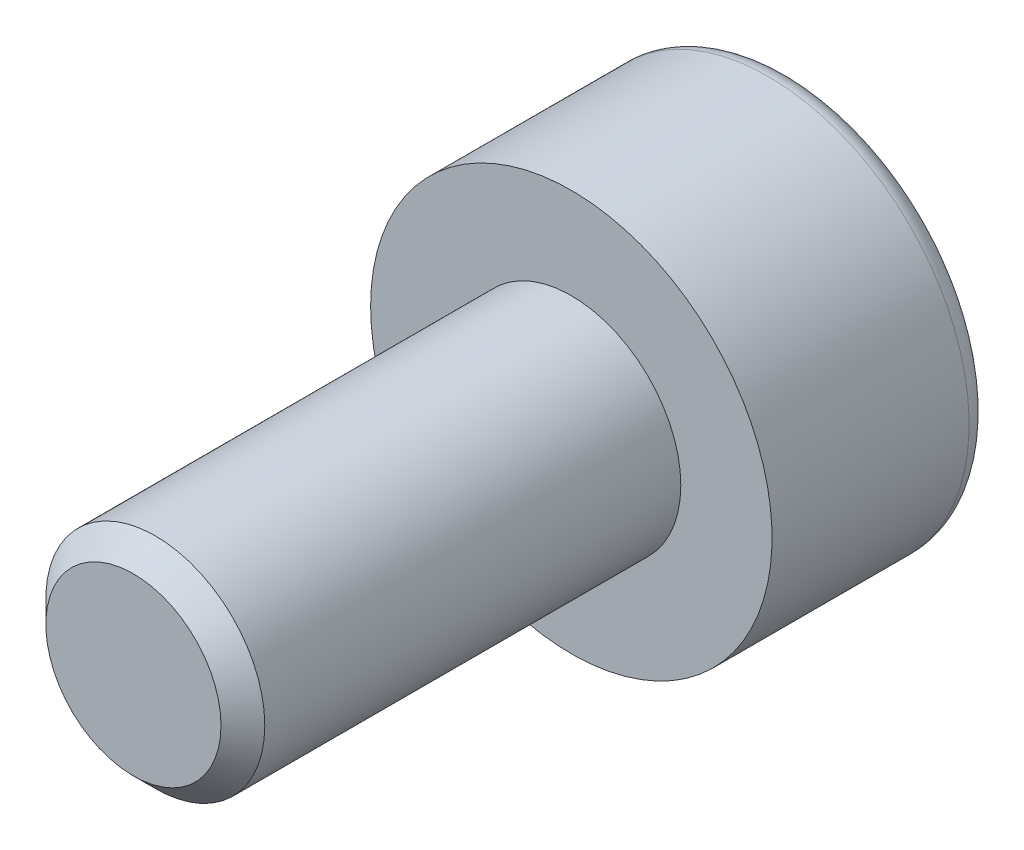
ISO-10303-21;
HEADER;
FILE_DESCRIPTION(('STEP AP214'),'2;1');
FILE_NAME('part.step','',(''),(''),'','','');
FILE_SCHEMA(('AUTOMOTIVE_DESIGN { 1 0 10303 214 1 1 1 1 }'));
ENDSEC;
DATA;
#1=APPLICATION_CONTEXT('core data for automotive mechanical design processes');
#2=APPLICATION_PROTOCOL_DEFINITION('international standard','automotive_design',2000,#1);
#3=PRODUCT_CONTEXT('',#1,'mechanical');
#4=PRODUCT('Part','Part','',(#3));
#5=PRODUCT_RELATED_PRODUCT_CATEGORY('part','',(#4));
#6=PRODUCT_DEFINITION_FORMATION('','',#4);
#7=PRODUCT_DEFINITION_CONTEXT('part definition',#1,'design');
#8=PRODUCT_DEFINITION('design','',#6,#7);
#9=PRODUCT_DEFINITION_SHAPE('','',#8);
#10=(LENGTH_UNIT() NAMED_UNIT(*) SI_UNIT(.MILLI.,.METRE.));
#11=(NAMED_UNIT(*) PLANE_ANGLE_UNIT() SI_UNIT($,.RADIAN.));
#12=(NAMED_UNIT(*) SI_UNIT($,.STERADIAN.) SOLID_ANGLE_UNIT());
#13=UNCERTAINTY_MEASURE_WITH_UNIT(LENGTH_MEASURE(1.E-05),#10,'distance_accuracy_value','');
#14=(GEOMETRIC_REPRESENTATION_CONTEXT(3) GLOBAL_UNCERTAINTY_ASSIGNED_CONTEXT((#13)) GLOBAL_UNIT_ASSIGNED_CONTEXT((#10,
#11,#12)) REPRESENTATION_CONTEXT('',''));
#15=CARTESIAN_POINT('',(0.,0.,0.));
#16=DIRECTION('',(0.,0.,1.));
#17=DIRECTION('',(1.,0.,0.));
#18=AXIS2_PLACEMENT_3D('',#15,#16,#17);
#19=CARTESIAN_POINT('',(0.,0.,-3.));
#20=DIRECTION('',(0.,0.,0.999999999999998));
#21=DIRECTION('',(0.999999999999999,0.,0.));
#22=AXIS2_PLACEMENT_3D('',#19,#20,#21);
#23=PLANE('',#22);
#24=CARTESIAN_POINT('',(0.,0.,-3.));
#25=DIRECTION('',(0.,0.,-0.999999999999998));
#26=DIRECTION('',(-0.999999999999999,0.,0.));
#27=AXIS2_PLACEMENT_3D('',#24,#25,#26);
#28=CIRCLE('',#27,2.45);
#29=CARTESIAN_POINT('',(-2.45,0.,-3.));
#30=VERTEX_POINT('',#29);
#31=EDGE_CURVE('E147',#30,#30,#28,.T.);
#32=ORIENTED_EDGE('',*,*,#31,.T.);
#33=EDGE_LOOP('',(#32));
#34=FACE_BOUND('',#33,.T.);
#35=DIRECTION('',(-0.86602540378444,0.499999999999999,0.));
#36=VECTOR('',#35,1.);
#37=CARTESIAN_POINT('',(0.,1.44337567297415,-2.99999999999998));
#38=LINE('',#37,#36);
#39=CARTESIAN_POINT('',(1.25000000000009,0.721687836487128,-2.99999999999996));
#40=VERTEX_POINT('',#39);
#41=CARTESIAN_POINT('',(0.,1.44337567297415,-2.99999999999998));
#42=VERTEX_POINT('',#41);
#43=EDGE_CURVE('E49',#40,#42,#38,.T.);
#44=ORIENTED_EDGE('',*,*,#43,.T.);
#45=DIRECTION('',(-0.866025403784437,-0.500000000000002,0.));
#46=VECTOR('',#45,1.);
#47=CARTESIAN_POINT('',(0.,1.44337567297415,-2.99999999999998));
#48=LINE('',#47,#46);
#49=CARTESIAN_POINT('',(-1.24999999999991,0.721687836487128,-3.));
#50=VERTEX_POINT('',#49);
#51=EDGE_CURVE('E120',#42,#50,#48,.T.);
#52=ORIENTED_EDGE('',*,*,#51,.T.);
#53=DIRECTION('',(0.,-1.,0.));
#54=VECTOR('',#53,1.);
#55=CARTESIAN_POINT('',(-1.2499999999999,-0.721687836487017,-3.00000000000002));
#56=LINE('',#55,#54);
#57=CARTESIAN_POINT('',(-1.2499999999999,-0.721687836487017,-3.00000000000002));
#58=VERTEX_POINT('',#57);
#59=EDGE_CURVE('E124',#50,#58,#56,.T.);
#60=ORIENTED_EDGE('',*,*,#59,.T.);
#61=DIRECTION('',(0.866025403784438,-0.500000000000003,0.));
#62=VECTOR('',#61,1.);
#63=CARTESIAN_POINT('',(0.,-1.44337567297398,-3.));
#64=LINE('',#63,#62);
#65=CARTESIAN_POINT('',(0.,-1.44337567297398,-3.));
#66=VERTEX_POINT('',#65);
#67=EDGE_CURVE('E127',#58,#66,#64,.T.);
#68=ORIENTED_EDGE('',*,*,#67,.T.);
#69=DIRECTION('',(0.866025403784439,0.499999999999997,0.));
#70=VECTOR('',#69,1.);
#71=CARTESIAN_POINT('',(0.,-1.44337567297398,-3.));
#72=LINE('',#71,#70);
#73=CARTESIAN_POINT('',(1.2500000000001,-0.721687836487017,-3.00000000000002));
#74=VERTEX_POINT('',#73);
#75=EDGE_CURVE('E110',#66,#74,#72,.T.);
#76=ORIENTED_EDGE('',*,*,#75,.T.);
#77=DIRECTION('',(0.,1.,0.));
#78=VECTOR('',#77,1.);
#79=CARTESIAN_POINT('',(1.2500000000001,-0.721687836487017,-3.00000000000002));
#80=LINE('',#79,#78);
#81=EDGE_CURVE('E130',#74,#40,#80,.T.);
#82=ORIENTED_EDGE('',*,*,#81,.T.);
#83=EDGE_LOOP('',(#44,#52,#60,#68,#76,#82));
#84=FACE_BOUND('',#83,.T.);
#85=ADVANCED_FACE('F34',(#34,#84),#23,.F.);
#86=CARTESIAN_POINT('',(0.,0.,-2.69999999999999));
#87=DIRECTION('',(0.,0.,-0.999999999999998));
#88=DIRECTION('',(-0.999999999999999,0.,0.));
#89=AXIS2_PLACEMENT_3D('',#86,#87,#88);
#90=TOROIDAL_SURFACE('',#89,2.45,0.299999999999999);
#91=ORIENTED_EDGE('',*,*,#31,.F.);
#92=EDGE_LOOP('',(#91));
#93=FACE_BOUND('',#92,.T.);
#94=CARTESIAN_POINT('',(0.,0.,-2.69999999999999));
#95=DIRECTION('',(0.,0.,-0.999999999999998));
#96=DIRECTION('',(-0.999999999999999,0.,0.));
#97=AXIS2_PLACEMENT_3D('',#94,#95,#96);
#98=CIRCLE('',#97,2.75);
#99=CARTESIAN_POINT('',(-2.75,0.,-2.7));
#100=VERTEX_POINT('',#99);
#101=EDGE_CURVE('E144',#100,#100,#98,.T.);
#102=ORIENTED_EDGE('',*,*,#101,.T.);
#103=EDGE_LOOP('',(#102));
#104=FACE_BOUND('',#103,.T.);
#105=ADVANCED_FACE('F164',(#93,#104),#90,.T.);
#106=CARTESIAN_POINT('',(0.,0.,0.));
#107=DIRECTION('',(0.,0.,-0.999999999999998));
#108=DIRECTION('',(-0.999999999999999,0.,0.));
#109=AXIS2_PLACEMENT_3D('',#106,#107,#108);
#110=CYLINDRICAL_SURFACE('',#109,2.75);
#111=CARTESIAN_POINT('',(0.,0.,0.));
#112=DIRECTION('',(0.,0.,-0.999999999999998));
#113=DIRECTION('',(-0.999999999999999,0.,0.));
#114=AXIS2_PLACEMENT_3D('',#111,#112,#113);
#115=CIRCLE('',#114,2.75);
#116=CARTESIAN_POINT('',(-2.75,0.,0.));
#117=VERTEX_POINT('',#116);
#118=EDGE_CURVE('E141',#117,#117,#115,.T.);
#119=CARTESIAN_POINT('',(-2.75,0.,-2.7));
#120=CARTESIAN_POINT('',(-2.75,0.,-2.671875));
#121=CARTESIAN_POINT('',(-2.75,0.,-2.64375));
#122=CARTESIAN_POINT('',(-2.75,0.,-2.5875));
#123=CARTESIAN_POINT('',(-2.75,0.,-2.559375));
#124=CARTESIAN_POINT('',(-2.75,0.,-2.503125));
#125=CARTESIAN_POINT('',(-2.75,0.,-2.475));
#126=CARTESIAN_POINT('',(-2.75,0.,-2.41875));
#127=CARTESIAN_POINT('',(-2.75,0.,-2.390625));
#128=CARTESIAN_POINT('',(-2.75,0.,-2.334375));
#129=CARTESIAN_POINT('',(-2.75,0.,-2.30625));
#130=CARTESIAN_POINT('',(-2.75,0.,-2.25));
#131=CARTESIAN_POINT('',(-2.75,0.,-2.221875));
#132=CARTESIAN_POINT('',(-2.75,0.,-2.165625));
#133=CARTESIAN_POINT('',(-2.75,0.,-2.1375));
#134=CARTESIAN_POINT('',(-2.75,0.,-2.08125));
#135=CARTESIAN_POINT('',(-2.75,0.,-2.053125));
#136=CARTESIAN_POINT('',(-2.75,0.,-1.996875));
#137=CARTESIAN_POINT('',(-2.75,0.,-1.96875));
#138=CARTESIAN_POINT('',(-2.75,0.,-1.9125));
#139=CARTESIAN_POINT('',(-2.75,0.,-1.884375));
#140=CARTESIAN_POINT('',(-2.75,0.,-1.828125));
#141=CARTESIAN_POINT('',(-2.75,0.,-1.8));
#142=CARTESIAN_POINT('',(-2.75,0.,-1.74375));
#143=CARTESIAN_POINT('',(-2.75,0.,-1.715625));
#144=CARTESIAN_POINT('',(-2.75,0.,-1.659375));
#145=CARTESIAN_POINT('',(-2.75,0.,-1.63125));
#146=CARTESIAN_POINT('',(-2.75,0.,-1.575));
#147=CARTESIAN_POINT('',(-2.75,0.,-1.546875));
#148=CARTESIAN_POINT('',(-2.75,0.,-1.490625));
#149=CARTESIAN_POINT('',(-2.75,0.,-1.4625));
#150=CARTESIAN_POINT('',(-2.75,0.,-1.40625));
#151=CARTESIAN_POINT('',(-2.75,0.,-1.378125));
#152=CARTESIAN_POINT('',(-2.75,0.,-1.321875));
#153=CARTESIAN_POINT('',(-2.75,0.,-1.29375));
#154=CARTESIAN_POINT('',(-2.75,0.,-1.2375));
#155=CARTESIAN_POINT('',(-2.75,0.,-1.209375));
#156=CARTESIAN_POINT('',(-2.75,0.,-1.153125));
#157=CARTESIAN_POINT('',(-2.75,0.,-1.125));
#158=CARTESIAN_POINT('',(-2.75,0.,-1.06875));
#159=CARTESIAN_POINT('',(-2.75,0.,-1.040625));
#160=CARTESIAN_POINT('',(-2.75,0.,-0.984375));
#161=CARTESIAN_POINT('',(-2.75,0.,-0.95625));
#162=CARTESIAN_POINT('',(-2.75,0.,-0.9));
#163=CARTESIAN_POINT('',(-2.75,0.,-0.871875));
#164=CARTESIAN_POINT('',(-2.75,0.,-0.815625));
#165=CARTESIAN_POINT('',(-2.75,0.,-0.7875));
#166=CARTESIAN_POINT('',(-2.75,0.,-0.73125));
#167=CARTESIAN_POINT('',(-2.75,0.,-0.703125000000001));
#168=CARTESIAN_POINT('',(-2.75,0.,-0.646875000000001));
#169=CARTESIAN_POINT('',(-2.75,0.,-0.618750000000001));
#170=CARTESIAN_POINT('',(-2.75,0.,-0.562500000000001));
#171=CARTESIAN_POINT('',(-2.75,0.,-0.534375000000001));
#172=CARTESIAN_POINT('',(-2.75,0.,-0.478125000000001));
#173=CARTESIAN_POINT('',(-2.75,0.,-0.450000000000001));
#174=CARTESIAN_POINT('',(-2.75,0.,-0.393750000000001));
#175=CARTESIAN_POINT('',(-2.75,0.,-0.365625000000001));
#176=CARTESIAN_POINT('',(-2.75,0.,-0.309375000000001));
#177=CARTESIAN_POINT('',(-2.75,0.,-0.281250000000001));
#178=CARTESIAN_POINT('',(-2.75,0.,-0.225000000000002));
#179=CARTESIAN_POINT('',(-2.75,0.,-0.196875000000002));
#180=CARTESIAN_POINT('',(-2.75,0.,-0.140625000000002));
#181=CARTESIAN_POINT('',(-2.75,0.,-0.112500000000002));
#182=CARTESIAN_POINT('',(-2.75,0.,-0.0562500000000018));
#183=CARTESIAN_POINT('',(-2.75,0.,-0.0281250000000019));
#184=CARTESIAN_POINT('',(-2.75,0.,0.));
#185=B_SPLINE_CURVE_WITH_KNOTS('',3,(#119,#120,#121,#122,#123,#124,#125,#126,#127,#128,#129,
#130,#131,#132,#133,#134,#135,#136,#137,#138,#139,#140,#141,#142,#143,#144,#145,#146,#147,#148,
#149,#150,#151,#152,#153,#154,#155,#156,#157,#158,#159,#160,#161,#162,#163,#164,#165,#166,#167,
#168,#169,#170,#171,#172,#173,#174,#175,#176,#177,#178,#179,#180,#181,#182,#183,#184),
.UNSPECIFIED.,.F.,.F.,(4,2,2,2,2,2,2,2,2,2,2,2,2,2,2,2,2,2,2,2,2,2,2,2,2,2,2,2,2,2,2,2,4),(0.,
0.0843749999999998,0.16875,0.253124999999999,0.337499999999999,0.421874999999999,
0.506249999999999,0.590624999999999,0.674999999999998,0.759374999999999,0.843749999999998,
0.928124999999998,1.0125,1.096875,1.18125,1.265625,1.35,1.434375,1.51875,1.603125,1.6875,
1.771875,1.85625,1.940625,2.025,2.109375,2.19375,2.27812499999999,2.3625,2.446875,
2.53124999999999,2.615625,2.69999999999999),.UNSPECIFIED.);
#186=EDGE_CURVE('BSEAM169',#100,#117,#185,.T.);
#187=ORIENTED_EDGE('',*,*,#101,.F.);
#188=ORIENTED_EDGE('',*,*,#118,.T.);
#189=ORIENTED_EDGE('',*,*,#186,.T.);
#190=ORIENTED_EDGE('',*,*,#186,.F.);
#191=EDGE_LOOP('',(#187,#189,#188,#190));
#192=FACE_BOUND('',#191,.T.);
#193=ADVANCED_FACE('F169',(#192),#110,.T.);
#194=CARTESIAN_POINT('',(0.,0.,0.));
#195=DIRECTION('',(0.,0.,-0.999999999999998));
#196=DIRECTION('',(-0.999999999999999,0.,0.));
#197=AXIS2_PLACEMENT_3D('',#194,#195,#196);
#198=PLANE('',#197);
#199=CARTESIAN_POINT('',(0.,0.,0.));
#200=DIRECTION('',(0.,0.,0.999999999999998));
#201=DIRECTION('',(0.999999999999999,0.,0.));
#202=AXIS2_PLACEMENT_3D('',#199,#200,#201);
#203=CIRCLE('',#202,1.5);
#204=CARTESIAN_POINT('',(1.5,0.,0.));
#205=VERTEX_POINT('',#204);
#206=EDGE_CURVE('E121',#205,#205,#203,.T.);
#207=ORIENTED_EDGE('',*,*,#206,.F.);
#208=EDGE_LOOP('',(#207));
#209=FACE_BOUND('',#208,.T.);
#210=ORIENTED_EDGE('',*,*,#118,.F.);
#211=EDGE_LOOP('',(#210));
#212=FACE_BOUND('',#211,.T.);
#213=ADVANCED_FACE('F176',(#209,#212),#198,.F.);
#214=CARTESIAN_POINT('',(0.,1.44337567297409,-1.69999999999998));
#215=DIRECTION('',(-0.499999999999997,-0.86602540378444,0.));
#216=DIRECTION('',(0.86602540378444,-0.499999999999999,0.));
#217=AXIS2_PLACEMENT_3D('',#214,#215,#216);
#218=PLANE('',#217);
#219=ORIENTED_EDGE('',*,*,#43,.F.);
#220=DIRECTION('',(0.,0.,-0.999999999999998));
#221=VECTOR('',#220,1.);
#222=CARTESIAN_POINT('',(1.24999999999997,0.721687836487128,-1.69999999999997));
#223=LINE('',#222,#221);
#224=CARTESIAN_POINT('',(1.24999999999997,0.721687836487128,-1.69999999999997));
#225=VERTEX_POINT('',#224);
#226=EDGE_CURVE('E115',#225,#40,#223,.T.);
#227=ORIENTED_EDGE('',*,*,#226,.F.);
#228=DIRECTION('',(-0.86602540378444,0.499999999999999,0.));
#229=VECTOR('',#228,1.);
#230=CARTESIAN_POINT('',(0.,1.44337567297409,-1.69999999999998));
#231=LINE('',#230,#229);
#232=CARTESIAN_POINT('',(0.,1.44337567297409,-1.69999999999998));
#233=VERTEX_POINT('',#232);
#234=EDGE_CURVE('E133',#225,#233,#231,.T.);
#235=ORIENTED_EDGE('',*,*,#234,.T.);
#236=DIRECTION('',(0.,0.,-0.999999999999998));
#237=VECTOR('',#236,1.);
#238=CARTESIAN_POINT('',(0.,1.44337567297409,-1.69999999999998));
#239=LINE('',#238,#237);
#240=EDGE_CURVE('E139',#233,#42,#239,.T.);
#241=ORIENTED_EDGE('',*,*,#240,.T.);
#242=EDGE_LOOP('',(#219,#227,#235,#241));
#243=FACE_BOUND('',#242,.T.);
#244=ADVANCED_FACE('F180',(#243),#218,.T.);
#245=CARTESIAN_POINT('',(0.,1.44337567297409,-1.69999999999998));
#246=DIRECTION('',(0.500000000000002,-0.866025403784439,0.));
#247=DIRECTION('',(0.866025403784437,0.500000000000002,0.));
#248=AXIS2_PLACEMENT_3D('',#245,#246,#247);
#249=PLANE('',#248);
#250=ORIENTED_EDGE('',*,*,#51,.F.);
#251=ORIENTED_EDGE('',*,*,#240,.F.);
#252=DIRECTION('',(-0.866025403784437,-0.500000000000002,0.));
#253=VECTOR('',#252,1.);
#254=CARTESIAN_POINT('',(0.,1.44337567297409,-1.69999999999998));
#255=LINE('',#254,#253);
#256=CARTESIAN_POINT('',(-1.25000000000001,0.721687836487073,-1.69999999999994));
#257=VERTEX_POINT('',#256);
#258=EDGE_CURVE('E88',#233,#257,#255,.T.);
#259=ORIENTED_EDGE('',*,*,#258,.T.);
#260=DIRECTION('',(0.,0.,-0.999999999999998));
#261=VECTOR('',#260,1.);
#262=CARTESIAN_POINT('',(-1.25000000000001,0.721687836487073,-1.69999999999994));
#263=LINE('',#262,#261);
#264=EDGE_CURVE('E137',#257,#50,#263,.T.);
#265=ORIENTED_EDGE('',*,*,#264,.T.);
#266=EDGE_LOOP('',(#250,#251,#259,#265));
#267=FACE_BOUND('',#266,.T.);
#268=ADVANCED_FACE('F184',(#267),#249,.T.);
#269=CARTESIAN_POINT('',(-1.24999999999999,-0.721687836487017,-1.70000000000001));
#270=DIRECTION('',(0.999999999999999,0.,0.));
#271=DIRECTION('',(0.,0.,-0.999999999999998));
#272=AXIS2_PLACEMENT_3D('',#269,#270,#271);
#273=PLANE('',#272);
#274=ORIENTED_EDGE('',*,*,#59,.F.);
#275=ORIENTED_EDGE('',*,*,#264,.F.);
#276=DIRECTION('',(0.,-1.,0.));
#277=VECTOR('',#276,1.);
#278=CARTESIAN_POINT('',(-1.24999999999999,-0.721687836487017,-1.70000000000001));
#279=LINE('',#278,#277);
#280=CARTESIAN_POINT('',(-1.24999999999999,-0.721687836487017,-1.70000000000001));
#281=VERTEX_POINT('',#280);
#282=EDGE_CURVE('E106',#257,#281,#279,.T.);
#283=ORIENTED_EDGE('',*,*,#282,.T.);
#284=DIRECTION('',(0.,0.,-0.999999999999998));
#285=VECTOR('',#284,1.);
#286=CARTESIAN_POINT('',(-1.24999999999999,-0.721687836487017,-1.70000000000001));
#287=LINE('',#286,#285);
#288=EDGE_CURVE('E103',#281,#58,#287,.T.);
#289=ORIENTED_EDGE('',*,*,#288,.T.);
#290=EDGE_LOOP('',(#274,#275,#283,#289));
#291=FACE_BOUND('',#290,.T.);
#292=ADVANCED_FACE('F187',(#291),#273,.T.);
#293=CARTESIAN_POINT('',(0.,-1.44337567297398,-1.69999999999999));
#294=DIRECTION('',(0.500000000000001,0.866025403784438,0.));
#295=DIRECTION('',(-0.866025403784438,0.500000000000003,0.));
#296=AXIS2_PLACEMENT_3D('',#293,#294,#295);
#297=PLANE('',#296);
#298=ORIENTED_EDGE('',*,*,#67,.F.);
#299=ORIENTED_EDGE('',*,*,#288,.F.);
#300=DIRECTION('',(0.866025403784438,-0.500000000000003,0.));
#301=VECTOR('',#300,1.);
#302=CARTESIAN_POINT('',(0.,-1.44337567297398,-1.69999999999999));
#303=LINE('',#302,#301);
#304=CARTESIAN_POINT('',(0.,-1.44337567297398,-1.69999999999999));
#305=VERTEX_POINT('',#304);
#306=EDGE_CURVE('E98',#281,#305,#303,.T.);
#307=ORIENTED_EDGE('',*,*,#306,.T.);
#308=DIRECTION('',(0.,0.,-0.999999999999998));
#309=VECTOR('',#308,1.);
#310=CARTESIAN_POINT('',(0.,-1.44337567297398,-1.69999999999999));
#311=LINE('',#310,#309);
#312=EDGE_CURVE('E102',#305,#66,#311,.T.);
#313=ORIENTED_EDGE('',*,*,#312,.T.);
#314=EDGE_LOOP('',(#298,#299,#307,#313));
#315=FACE_BOUND('',#314,.T.);
#316=ADVANCED_FACE('F101',(#315),#297,.T.);
#317=CARTESIAN_POINT('',(0.,-1.44337567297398,-1.69999999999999));
#318=DIRECTION('',(-0.499999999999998,0.866025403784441,0.));
#319=DIRECTION('',(-0.866025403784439,-0.499999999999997,0.));
#320=AXIS2_PLACEMENT_3D('',#317,#318,#319);
#321=PLANE('',#320);
#322=ORIENTED_EDGE('',*,*,#75,.F.);
#323=ORIENTED_EDGE('',*,*,#312,.F.);
#324=DIRECTION('',(0.866025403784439,0.499999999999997,0.));
#325=VECTOR('',#324,1.);
#326=CARTESIAN_POINT('',(0.,-1.44337567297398,-1.69999999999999));
#327=LINE('',#326,#325);
#328=CARTESIAN_POINT('',(1.25000000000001,-0.721687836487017,-1.70000000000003));
#329=VERTEX_POINT('',#328);
#330=EDGE_CURVE('E105',#305,#329,#327,.T.);
#331=ORIENTED_EDGE('',*,*,#330,.T.);
#332=DIRECTION('',(0.,0.,-0.999999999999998));
#333=VECTOR('',#332,1.);
#334=CARTESIAN_POINT('',(1.25000000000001,-0.721687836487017,-1.70000000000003));
#335=LINE('',#334,#333);
#336=EDGE_CURVE('E79',#329,#74,#335,.T.);
#337=ORIENTED_EDGE('',*,*,#336,.T.);
#338=EDGE_LOOP('',(#322,#323,#331,#337));
#339=FACE_BOUND('',#338,.T.);
#340=ADVANCED_FACE('F108',(#339),#321,.T.);
#341=CARTESIAN_POINT('',(1.25000000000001,-0.721687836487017,-1.70000000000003));
#342=DIRECTION('',(-0.999999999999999,0.,0.));
#343=DIRECTION('',(0.,0.,0.999999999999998));
#344=AXIS2_PLACEMENT_3D('',#341,#342,#343);
#345=PLANE('',#344);
#346=ORIENTED_EDGE('',*,*,#81,.F.);
#347=ORIENTED_EDGE('',*,*,#336,.F.);
#348=DIRECTION('',(0.,1.,0.));
#349=VECTOR('',#348,1.);
#350=CARTESIAN_POINT('',(1.25000000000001,-0.721687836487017,-1.70000000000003));
#351=LINE('',#350,#349);
#352=EDGE_CURVE('E57',#329,#225,#351,.T.);
#353=ORIENTED_EDGE('',*,*,#352,.T.);
#354=ORIENTED_EDGE('',*,*,#226,.T.);
#355=EDGE_LOOP('',(#346,#347,#353,#354));
#356=FACE_BOUND('',#355,.T.);
#357=ADVANCED_FACE('F196',(#356),#345,.T.);
#358=CARTESIAN_POINT('',(1.24999999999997,0.721687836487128,-1.69999999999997));
#359=DIRECTION('',(0.,0.,0.999999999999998));
#360=DIRECTION('',(0.999999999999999,0.,0.));
#361=AXIS2_PLACEMENT_3D('',#358,#359,#360);
#362=PLANE('',#361);
#363=ORIENTED_EDGE('',*,*,#234,.F.);
#364=ORIENTED_EDGE('',*,*,#352,.F.);
#365=ORIENTED_EDGE('',*,*,#330,.F.);
#366=ORIENTED_EDGE('',*,*,#306,.F.);
#367=ORIENTED_EDGE('',*,*,#282,.F.);
#368=ORIENTED_EDGE('',*,*,#258,.F.);
#369=EDGE_LOOP('',(#363,#364,#365,#366,#367,#368));
#370=FACE_BOUND('',#369,.T.);
#371=ADVANCED_FACE('F113',(#370),#362,.F.);
#372=CARTESIAN_POINT('',(0.,0.,5.99999999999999));
#373=DIRECTION('',(0.,0.,0.999999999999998));
#374=DIRECTION('',(0.999999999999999,0.,0.));
#375=AXIS2_PLACEMENT_3D('',#372,#373,#374);
#376=PLANE('',#375);
#377=CARTESIAN_POINT('',(0.,0.,5.99999999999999));
#378=DIRECTION('',(0.,0.,0.999999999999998));
#379=DIRECTION('',(0.999999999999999,0.,0.));
#380=AXIS2_PLACEMENT_3D('',#377,#378,#379);
#381=CIRCLE('',#380,1.2);
#382=CARTESIAN_POINT('',(1.19999999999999,0.,5.99999999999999));
#383=VERTEX_POINT('',#382);
#384=EDGE_CURVE('E42',#383,#383,#381,.T.);
#385=ORIENTED_EDGE('',*,*,#384,.T.);
#386=EDGE_LOOP('',(#385));
#387=FACE_BOUND('',#386,.T.);
#388=ADVANCED_FACE('F152',(#387),#376,.T.);
#389=CARTESIAN_POINT('',(0.,0.,0.));
#390=DIRECTION('',(0.,0.,0.999999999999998));
#391=DIRECTION('',(0.999999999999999,0.,0.));
#392=AXIS2_PLACEMENT_3D('',#389,#390,#391);
#393=CYLINDRICAL_SURFACE('',#392,1.5);
#394=CARTESIAN_POINT('',(0.,0.,5.7));
#395=DIRECTION('',(0.,0.,0.999999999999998));
#396=DIRECTION('',(0.999999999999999,0.,0.));
#397=AXIS2_PLACEMENT_3D('',#394,#395,#396);
#398=CIRCLE('',#397,1.5);
#399=CARTESIAN_POINT('',(1.5,0.,5.7));
#400=VERTEX_POINT('',#399);
#401=EDGE_CURVE('E11',#400,#400,#398,.F.);
#402=CARTESIAN_POINT('',(1.5,0.,5.7));
#403=CARTESIAN_POINT('',(1.5,0.,5.640625));
#404=CARTESIAN_POINT('',(1.5,0.,5.58125));
#405=CARTESIAN_POINT('',(1.5,0.,5.4625));
#406=CARTESIAN_POINT('',(1.5,0.,5.403125));
#407=CARTESIAN_POINT('',(1.5,0.,5.284375));
#408=CARTESIAN_POINT('',(1.5,0.,5.225));
#409=CARTESIAN_POINT('',(1.5,0.,5.10625));
#410=CARTESIAN_POINT('',(1.5,0.,5.046875));
#411=CARTESIAN_POINT('',(1.5,0.,4.928125));
#412=CARTESIAN_POINT('',(1.5,0.,4.86875));
#413=CARTESIAN_POINT('',(1.5,0.,4.75));
#414=CARTESIAN_POINT('',(1.5,0.,4.690625));
#415=CARTESIAN_POINT('',(1.5,0.,4.571875));
#416=CARTESIAN_POINT('',(1.5,0.,4.5125));
#417=CARTESIAN_POINT('',(1.5,0.,4.39375));
#418=CARTESIAN_POINT('',(1.5,0.,4.334375));
#419=CARTESIAN_POINT('',(1.5,0.,4.215625));
#420=CARTESIAN_POINT('',(1.5,0.,4.15625));
#421=CARTESIAN_POINT('',(1.5,0.,4.0375));
#422=CARTESIAN_POINT('',(1.5,0.,3.978125));
#423=CARTESIAN_POINT('',(1.5,0.,3.859375));
#424=CARTESIAN_POINT('',(1.5,0.,3.8));
#425=CARTESIAN_POINT('',(1.5,0.,3.68125));
#426=CARTESIAN_POINT('',(1.5,0.,3.621875));
#427=CARTESIAN_POINT('',(1.5,0.,3.503125));
#428=CARTESIAN_POINT('',(1.5,0.,3.44375));
#429=CARTESIAN_POINT('',(1.5,0.,3.325));
#430=CARTESIAN_POINT('',(1.5,0.,3.265625));
#431=CARTESIAN_POINT('',(1.5,0.,3.146875));
#432=CARTESIAN_POINT('',(1.5,0.,3.0875));
#433=CARTESIAN_POINT('',(1.5,0.,2.96875));
#434=CARTESIAN_POINT('',(1.5,0.,2.909375));
#435=CARTESIAN_POINT('',(1.5,0.,2.790625));
#436=CARTESIAN_POINT('',(1.5,0.,2.73125));
#437=CARTESIAN_POINT('',(1.5,0.,2.6125));
#438=CARTESIAN_POINT('',(1.5,0.,2.553125));
#439=CARTESIAN_POINT('',(1.5,0.,2.434375));
#440=CARTESIAN_POINT('',(1.5,0.,2.375));
#441=CARTESIAN_POINT('',(1.5,0.,2.25625));
#442=CARTESIAN_POINT('',(1.5,0.,2.196875));
#443=CARTESIAN_POINT('',(1.5,0.,2.078125));
#444=CARTESIAN_POINT('',(1.5,0.,2.01875));
#445=CARTESIAN_POINT('',(1.5,0.,1.9));
#446=CARTESIAN_POINT('',(1.5,0.,1.840625));
#447=CARTESIAN_POINT('',(1.5,0.,1.721875));
#448=CARTESIAN_POINT('',(1.5,0.,1.6625));
#449=CARTESIAN_POINT('',(1.5,0.,1.54375));
#450=CARTESIAN_POINT('',(1.5,0.,1.484375));
#451=CARTESIAN_POINT('',(1.5,0.,1.365625));
#452=CARTESIAN_POINT('',(1.5,0.,1.30625));
#453=CARTESIAN_POINT('',(1.5,0.,1.1875));
#454=CARTESIAN_POINT('',(1.5,0.,1.128125));
#455=CARTESIAN_POINT('',(1.5,0.,1.009375));
#456=CARTESIAN_POINT('',(1.5,0.,0.95));
#457=CARTESIAN_POINT('',(1.5,0.,0.83125));
#458=CARTESIAN_POINT('',(1.5,0.,0.771875));
#459=CARTESIAN_POINT('',(1.5,0.,0.653125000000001));
#460=CARTESIAN_POINT('',(1.5,0.,0.593750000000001));
#461=CARTESIAN_POINT('',(1.5,0.,0.475000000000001));
#462=CARTESIAN_POINT('',(1.5,0.,0.415625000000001));
#463=CARTESIAN_POINT('',(1.5,0.,0.296875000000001));
#464=CARTESIAN_POINT('',(1.5,0.,0.2375));
#465=CARTESIAN_POINT('',(1.5,0.,0.118750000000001));
#466=CARTESIAN_POINT('',(1.5,0.,0.0593750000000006));
#467=CARTESIAN_POINT('',(1.5,0.,0.));
#468=B_SPLINE_CURVE_WITH_KNOTS('',3,(#402,#403,#404,#405,#406,#407,#408,#409,#410,#411,#412,
#413,#414,#415,#416,#417,#418,#419,#420,#421,#422,#423,#424,#425,#426,#427,#428,#429,#430,#431,
#432,#433,#434,#435,#436,#437,#438,#439,#440,#441,#442,#443,#444,#445,#446,#447,#448,#449,#450,
#451,#452,#453,#454,#455,#456,#457,#458,#459,#460,#461,#462,#463,#464,#465,#466,#467),
.UNSPECIFIED.,.F.,.F.,(4,2,2,2,2,2,2,2,2,2,2,2,2,2,2,2,2,2,2,2,2,2,2,2,2,2,2,2,2,2,2,2,4),(0.,
0.178124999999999,0.35625,0.534375,0.7125,0.890624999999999,1.06875,1.246875,1.425,1.603125,
1.78125,1.959375,2.1375,2.315625,2.49375,2.671875,2.85,3.028125,3.20625,3.384375,3.5625,
3.740625,3.91875,4.096875,4.275,4.453125,4.63125,4.809375,4.9875,5.165625,5.34375,5.521875,5.7),.UNSPECIFIED.);
#469=EDGE_CURVE('BSEAM155',#400,#205,#468,.T.);
#470=ORIENTED_EDGE('',*,*,#401,.T.);
#471=ORIENTED_EDGE('',*,*,#206,.T.);
#472=ORIENTED_EDGE('',*,*,#469,.T.);
#473=ORIENTED_EDGE('',*,*,#469,.F.);
#474=EDGE_LOOP('',(#470,#472,#471,#473));
#475=FACE_BOUND('',#474,.T.);
#476=ADVANCED_FACE('F155',(#475),#393,.T.);
#477=CARTESIAN_POINT('',(0.,0.,5.99999999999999));
#478=DIRECTION('',(0.,0.,-0.999999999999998));
#479=DIRECTION('',(-0.999999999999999,0.,0.));
#480=AXIS2_PLACEMENT_3D('',#477,#478,#479);
#481=CONICAL_SURFACE('',#480,1.2,0.785398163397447);
#482=ORIENTED_EDGE('',*,*,#401,.F.);
#483=EDGE_LOOP('',(#482));
#484=FACE_BOUND('',#483,.T.);
#485=ORIENTED_EDGE('',*,*,#384,.F.);
#486=EDGE_LOOP('',(#485));
#487=FACE_BOUND('',#486,.T.);
#488=ADVANCED_FACE('F36',(#484,#487),#481,.T.);
#489=CLOSED_SHELL('',(#85,#105,#193,#213,#244,#268,#292,#316,#340,#357,#371,#388,#476,#488));
#490=MANIFOLD_SOLID_BREP('B2',#489);
#491=ADVANCED_BREP_SHAPE_REPRESENTATION('',(#18,#490),#14);
#492=SHAPE_DEFINITION_REPRESENTATION(#9,#491);
ENDSEC;
END-ISO-10303-21;
